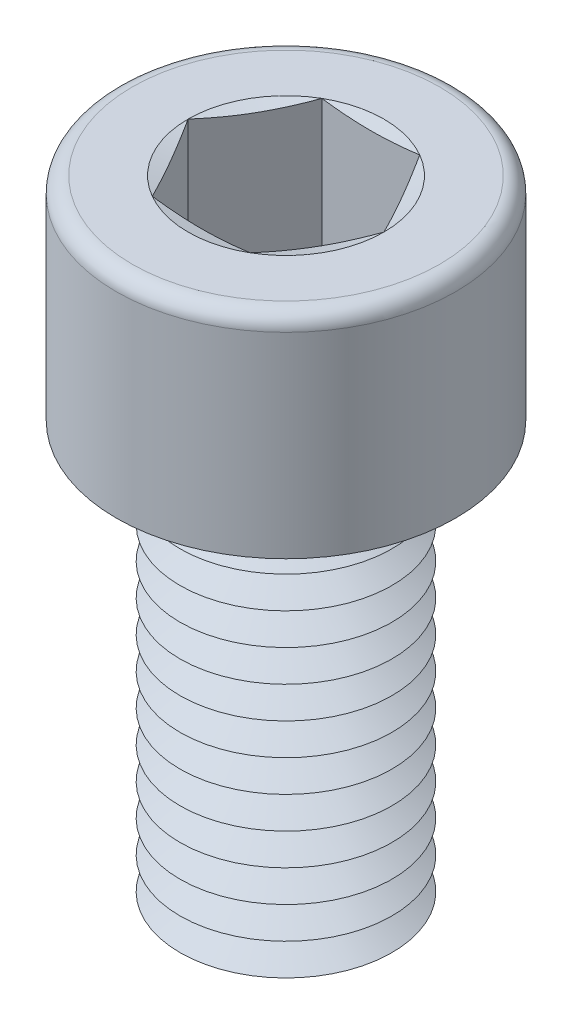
from build123d import *

# Parameters (mm, degrees)
SKETCH1_R       = 5
EXTRUDE1_DEPTH  = 20
SKETCH2_R       = 8
EXTRUDE2_DEPTH  = 10
EXTRUDE3_DEPTH  = 8
FILLET1_R       = 0.75
LPATTERN1_COUNT = 13
LPATTERN1_PITCH = 1.5


with BuildPart() as part:
    # Sketch1 → Extrude1 (new body)
    with BuildSketch(Plane(origin=(0, 0, 0), x_dir=(1, 0, 0), z_dir=(0, 1, 0))):
        with Locations(Location((0, 0, 0), (0, 0, 270))):
            Circle(SKETCH1_R)
    extrude(amount=EXTRUDE1_DEPTH)

    # Sketch2 → Extrude2 (add)
    with BuildSketch(Plane(origin=(0, 20, 0), x_dir=(1, 0, 0), z_dir=(0, 1, 0))):
        with Locations(Location((0, 0, 0), (0, 0, 270))):
            Circle(SKETCH2_R)
    extrude(amount=EXTRUDE2_DEPTH)

    # Sketch3 → Extrude3 (cut)
    with BuildSketch(Plane(origin=(0, 30, 0), x_dir=(1, 0, 0), z_dir=(0, 1, 0))):
        Polygon((2.309401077, 4), (-2.309401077, 4), (-4.618802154, 0), (-2.309401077, -4), (2.309401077, -4), (4.618802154, 0), align=None)
    extrude(amount=-EXTRUDE3_DEPTH, mode=Mode.SUBTRACT)

    # Fillet1
    fillet1_edges = [part.edges().sort_by_distance(p)[0] for p in [
        (0, 30, -8),
    ]]
    fillet(fillet1_edges, radius=FILLET1_R)

    # Sketch4 → Cut-Revolve1 (revolve, cut)
    with BuildSketch(Plane(origin=(0, 0, 0), x_dir=(0, 0, -1), z_dir=(1, 0, 0))):
        Polygon((-4, 22), (0, 22), (0, 19.690598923), align=None)
    revolve(axis=Axis((0, 22, 0), (0, -1, 0)), mode=Mode.SUBTRACT)

    # Sketch5 → Cut-Revolve2 (revolve, cut)
    with BuildSketch(Plane.XY, mode=Mode.PRIVATE) as cut_revolve2_sk:
        Polygon((-5, 0.75), (-5, -0.75), (-3.700961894, 0), align=None)
    cut_revolve2 = revolve(cut_revolve2_sk.sketch.rotate(Axis((0, 20, 0), (0, -1, 0)), 270), axis=Axis((0, 20, 0), (0, -1, 0)), mode=Mode.SUBTRACT)

    # LPattern1: Cut-Revolve2 ×13
    with Locations(*[(0, i * LPATTERN1_PITCH, 0) for i in range(1, LPATTERN1_COUNT)]):
        add(cut_revolve2, mode=Mode.SUBTRACT)

    # Extrude4 cone 1 section (on through the dimple's axis) → Extrude4 (revolve, cut)
    with BuildSketch(Plane(origin=(0, 30, 0), x_dir=(0, 0, 1), z_dir=(1, 0, 0))):
        Polygon((0, 0), (4.618802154, 0), (0, 1.237604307), align=None)
    revolve(axis=Axis((0, 30, 0), (0, -1, 0)), mode=Mode.SUBTRACT)


solid = part.part
